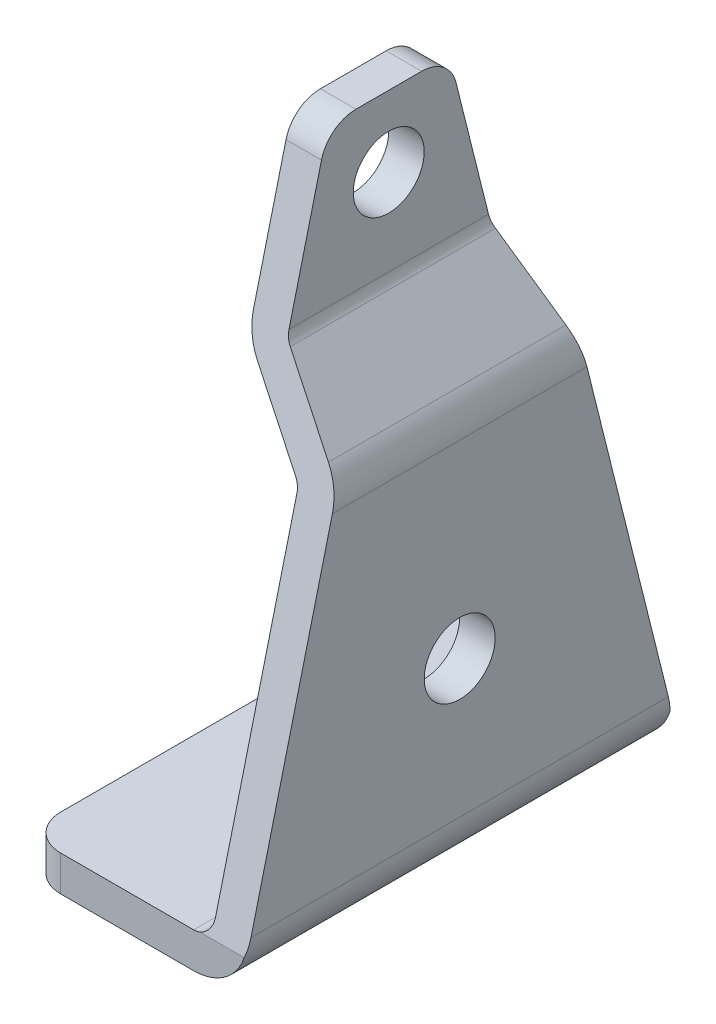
ISO-10303-21;
HEADER;
FILE_DESCRIPTION(('STEP AP214'),'2;1');
FILE_NAME('part.step','',(''),(''),'','','');
FILE_SCHEMA(('AUTOMOTIVE_DESIGN { 1 0 10303 214 1 1 1 1 }'));
ENDSEC;
DATA;
#1=APPLICATION_CONTEXT('core data for automotive mechanical design processes');
#2=APPLICATION_PROTOCOL_DEFINITION('international standard','automotive_design',2000,#1);
#3=PRODUCT_CONTEXT('',#1,'mechanical');
#4=PRODUCT('Part','Part','',(#3));
#5=PRODUCT_RELATED_PRODUCT_CATEGORY('part','',(#4));
#6=PRODUCT_DEFINITION_FORMATION('','',#4);
#7=PRODUCT_DEFINITION_CONTEXT('part definition',#1,'design');
#8=PRODUCT_DEFINITION('design','',#6,#7);
#9=PRODUCT_DEFINITION_SHAPE('','',#8);
#10=(LENGTH_UNIT() NAMED_UNIT(*) SI_UNIT(.MILLI.,.METRE.));
#11=(NAMED_UNIT(*) PLANE_ANGLE_UNIT() SI_UNIT($,.RADIAN.));
#12=(NAMED_UNIT(*) SI_UNIT($,.STERADIAN.) SOLID_ANGLE_UNIT());
#13=UNCERTAINTY_MEASURE_WITH_UNIT(LENGTH_MEASURE(1.E-05),#10,'distance_accuracy_value','');
#14=(GEOMETRIC_REPRESENTATION_CONTEXT(3) GLOBAL_UNCERTAINTY_ASSIGNED_CONTEXT((#13)) GLOBAL_UNIT_ASSIGNED_CONTEXT((#10,
#11,#12)) REPRESENTATION_CONTEXT('',''));
#15=CARTESIAN_POINT('',(0.,0.,0.));
#16=DIRECTION('',(0.,0.,1.));
#17=DIRECTION('',(1.,0.,0.));
#18=AXIS2_PLACEMENT_3D('',#15,#16,#17);
#19=CARTESIAN_POINT('',(0.,4.,48.));
#20=DIRECTION('',(1.,0.,0.));
#21=DIRECTION('',(0.,1.,0.));
#22=AXIS2_PLACEMENT_3D('',#19,#20,#21);
#23=PLANE('',#22);
#24=DIRECTION('',(0.,0.,-1.));
#25=VECTOR('',#24,1.);
#26=CARTESIAN_POINT('',(0.,0.,48.));
#27=LINE('',#26,#25);
#28=CARTESIAN_POINT('',(0.,0.,44.));
#29=VERTEX_POINT('',#28);
#30=CARTESIAN_POINT('',(0.,0.,4.));
#31=VERTEX_POINT('',#30);
#32=EDGE_CURVE('E221',#29,#31,#27,.T.);
#33=ORIENTED_EDGE('',*,*,#32,.F.);
#34=DIRECTION('',(0.,-1.,0.));
#35=VECTOR('',#34,1.);
#36=CARTESIAN_POINT('',(0.,4.,44.));
#37=LINE('',#36,#35);
#38=CARTESIAN_POINT('',(0.,4.,44.));
#39=VERTEX_POINT('',#38);
#40=EDGE_CURVE('E257',#29,#39,#37,.F.);
#41=ORIENTED_EDGE('',*,*,#40,.T.);
#42=DIRECTION('',(0.,0.,-1.));
#43=VECTOR('',#42,1.);
#44=CARTESIAN_POINT('',(0.,4.,48.));
#45=LINE('',#44,#43);
#46=CARTESIAN_POINT('',(0.,4.,4.));
#47=VERTEX_POINT('',#46);
#48=EDGE_CURVE('E266',#39,#47,#45,.T.);
#49=ORIENTED_EDGE('',*,*,#48,.T.);
#50=DIRECTION('',(0.,-1.,0.));
#51=VECTOR('',#50,1.);
#52=CARTESIAN_POINT('',(0.,0.,4.));
#53=LINE('',#52,#51);
#54=EDGE_CURVE('E254',#47,#31,#53,.T.);
#55=ORIENTED_EDGE('',*,*,#54,.T.);
#56=EDGE_LOOP('',(#33,#41,#49,#55));
#57=FACE_BOUND('',#56,.T.);
#58=ADVANCED_FACE('F34',(#57),#23,.F.);
#59=CARTESIAN_POINT('',(0.,0.,48.));
#60=DIRECTION('',(0.,1.,0.));
#61=DIRECTION('',(0.,0.,1.));
#62=AXIS2_PLACEMENT_3D('',#59,#60,#61);
#63=PLANE('',#62);
#64=DIRECTION('',(1.,0.,0.));
#65=VECTOR('',#64,1.);
#66=CARTESIAN_POINT('',(0.,0.,48.));
#67=LINE('',#66,#65);
#68=CARTESIAN_POINT('',(4.,0.,48.));
#69=VERTEX_POINT('',#68);
#70=CARTESIAN_POINT('',(19.,0.,48.));
#71=VERTEX_POINT('',#70);
#72=EDGE_CURVE('E282',#69,#71,#67,.T.);
#73=ORIENTED_EDGE('',*,*,#72,.F.);
#74=CARTESIAN_POINT('',(4.,0.,44.));
#75=DIRECTION('',(0.,1.,0.));
#76=DIRECTION('',(0.,0.,1.));
#77=AXIS2_PLACEMENT_3D('',#74,#75,#76);
#78=CIRCLE('',#77,4.);
#79=EDGE_CURVE('E252',#69,#29,#78,.F.);
#80=ORIENTED_EDGE('',*,*,#79,.T.);
#81=ORIENTED_EDGE('',*,*,#32,.T.);
#82=CARTESIAN_POINT('',(4.,0.,4.));
#83=DIRECTION('',(0.,1.,0.));
#84=DIRECTION('',(0.,0.,1.));
#85=AXIS2_PLACEMENT_3D('',#82,#83,#84);
#86=CIRCLE('',#85,4.);
#87=CARTESIAN_POINT('',(4.,0.,0.));
#88=VERTEX_POINT('',#87);
#89=EDGE_CURVE('E250',#31,#88,#86,.F.);
#90=ORIENTED_EDGE('',*,*,#89,.T.);
#91=DIRECTION('',(1.,0.,0.));
#92=VECTOR('',#91,1.);
#93=CARTESIAN_POINT('',(0.,0.,0.));
#94=LINE('',#93,#92);
#95=CARTESIAN_POINT('',(19.,0.,0.));
#96=VERTEX_POINT('',#95);
#97=EDGE_CURVE('E287',#88,#96,#94,.T.);
#98=ORIENTED_EDGE('',*,*,#97,.T.);
#99=DIRECTION('',(0.,0.,-1.));
#100=VECTOR('',#99,1.);
#101=CARTESIAN_POINT('',(19.,0.,48.));
#102=LINE('',#101,#100);
#103=EDGE_CURVE('E213',#71,#96,#102,.T.);
#104=ORIENTED_EDGE('',*,*,#103,.F.);
#105=EDGE_LOOP('',(#73,#80,#81,#90,#98,#104));
#106=FACE_BOUND('',#105,.T.);
#107=ADVANCED_FACE('F280',(#106),#63,.F.);
#108=CARTESIAN_POINT('',(19.,6.,48.));
#109=DIRECTION('',(0.,0.,-1.));
#110=DIRECTION('',(-1.,0.,0.));
#111=AXIS2_PLACEMENT_3D('',#108,#109,#110);
#112=CYLINDRICAL_SURFACE('',#111,6.);
#113=CARTESIAN_POINT('',(19.,6.,0.));
#114=DIRECTION('',(0.,0.,1.));
#115=DIRECTION('',(-1.,0.,0.));
#116=AXIS2_PLACEMENT_3D('',#113,#114,#115);
#117=CIRCLE('',#116,6.);
#118=CARTESIAN_POINT('',(24.7023240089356,4.13358608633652,0.));
#119=VERTEX_POINT('',#118);
#120=EDGE_CURVE('E292',#96,#119,#117,.T.);
#121=ORIENTED_EDGE('',*,*,#120,.T.);
#122=CARTESIAN_POINT('',(19.,6.,0.465349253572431));
#123=DIRECTION('',(0.,-0.24192189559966,0.970295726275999));
#124=DIRECTION('',(0.,-0.970295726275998,-0.24192189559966));
#125=AXIS2_PLACEMENT_3D('',#122,#123,#124);
#126=ELLIPSE('',#125,6.18368177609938,6.);
#127=CARTESIAN_POINT('',(25.,6.00000000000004,0.465349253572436));
#128=VERTEX_POINT('',#127);
#129=EDGE_CURVE('E195',#119,#128,#126,.T.);
#130=ORIENTED_EDGE('',*,*,#129,.T.);
#131=DIRECTION('',(0.,0.,-1.));
#132=VECTOR('',#131,1.);
#133=CARTESIAN_POINT('',(25.,6.00000000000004,48.));
#134=LINE('',#133,#132);
#135=CARTESIAN_POINT('',(25.,6.00000000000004,47.5346507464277));
#136=VERTEX_POINT('',#135);
#137=EDGE_CURVE('E204',#136,#128,#134,.T.);
#138=ORIENTED_EDGE('',*,*,#137,.F.);
#139=CARTESIAN_POINT('',(19.,6.,47.5346507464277));
#140=DIRECTION('',(0.,-0.241921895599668,-0.970295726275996));
#141=DIRECTION('',(0.,0.970295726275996,-0.241921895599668));
#142=AXIS2_PLACEMENT_3D('',#139,#140,#141);
#143=ELLIPSE('',#142,6.18368177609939,6.);
#144=CARTESIAN_POINT('',(24.7023240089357,4.13358608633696,48.));
#145=VERTEX_POINT('',#144);
#146=EDGE_CURVE('E293',#136,#145,#143,.T.);
#147=ORIENTED_EDGE('',*,*,#146,.T.);
#148=CARTESIAN_POINT('',(19.,6.,48.));
#149=DIRECTION('',(0.,0.,1.));
#150=DIRECTION('',(-1.,0.,0.));
#151=AXIS2_PLACEMENT_3D('',#148,#149,#150);
#152=CIRCLE('',#151,6.);
#153=EDGE_CURVE('E305',#71,#145,#152,.T.);
#154=ORIENTED_EDGE('',*,*,#153,.F.);
#155=ORIENTED_EDGE('',*,*,#103,.T.);
#156=EDGE_LOOP('',(#121,#130,#138,#147,#154,#155));
#157=FACE_BOUND('',#156,.T.);
#158=ADVANCED_FACE('F387',(#157),#112,.T.);
#159=CARTESIAN_POINT('',(25.,6.00000000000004,48.));
#160=DIRECTION('',(-1.,0.,0.));
#161=DIRECTION('',(0.,0.,1.));
#162=AXIS2_PLACEMENT_3D('',#159,#160,#161);
#163=PLANE('',#162);
#164=CARTESIAN_POINT('',(25.,21.5,24.));
#165=DIRECTION('',(1.,0.,0.));
#166=DIRECTION('',(0.,0.,-1.));
#167=AXIS2_PLACEMENT_3D('',#164,#165,#166);
#168=CIRCLE('',#167,4.);
#169=CARTESIAN_POINT('',(25.,21.5,20.));
#170=VERTEX_POINT('',#169);
#171=EDGE_CURVE('E593',#170,#170,#168,.T.);
#172=ORIENTED_EDGE('',*,*,#171,.F.);
#173=EDGE_LOOP('',(#172));
#174=FACE_BOUND('',#173,.T.);
#175=ORIENTED_EDGE('',*,*,#137,.T.);
#176=DIRECTION('',(0.,-0.970295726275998,-0.24192189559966));
#177=VECTOR('',#176,1.);
#178=CARTESIAN_POINT('',(25.,4.13358608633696,1.11022302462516E-13));
#179=LINE('',#178,#177);
#180=CARTESIAN_POINT('',(25.,42.8161785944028,9.64465353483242));
#181=VERTEX_POINT('',#180);
#182=EDGE_CURVE('E187',#181,#128,#179,.T.);
#183=ORIENTED_EDGE('',*,*,#182,.F.);
#184=DIRECTION('',(0.,0.,-1.));
#185=VECTOR('',#184,1.);
#186=CARTESIAN_POINT('',(25.,42.8161785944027,48.));
#187=LINE('',#186,#185);
#188=CARTESIAN_POINT('',(25.,42.8161785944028,38.3553464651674));
#189=VERTEX_POINT('',#188);
#190=EDGE_CURVE('E202',#189,#181,#187,.T.);
#191=ORIENTED_EDGE('',*,*,#190,.F.);
#192=DIRECTION('',(0.,0.970295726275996,-0.241921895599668));
#193=VECTOR('',#192,1.);
#194=CARTESIAN_POINT('',(25.,4.13358608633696,48.));
#195=LINE('',#194,#193);
#196=EDGE_CURVE('E355',#136,#189,#195,.T.);
#197=ORIENTED_EDGE('',*,*,#196,.F.);
#198=EDGE_LOOP('',(#175,#183,#191,#197));
#199=FACE_BOUND('',#198,.T.);
#200=ADVANCED_FACE('F200',(#174,#199),#163,.F.);
#201=CARTESIAN_POINT('',(19.,42.8161785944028,48.));
#202=DIRECTION('',(0.,0.,-1.));
#203=DIRECTION('',(-1.,0.,0.));
#204=AXIS2_PLACEMENT_3D('',#201,#202,#203);
#205=CYLINDRICAL_SURFACE('',#204,6.);
#206=ORIENTED_EDGE('',*,*,#190,.T.);
#207=CARTESIAN_POINT('',(19.,42.8161785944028,9.64465353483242));
#208=DIRECTION('',(0.,-0.24192189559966,0.970295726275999));
#209=DIRECTION('',(0.,-0.970295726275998,-0.24192189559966));
#210=AXIS2_PLACEMENT_3D('',#207,#208,#209);
#211=ELLIPSE('',#210,6.18368177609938,6.);
#212=CARTESIAN_POINT('',(23.5962666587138,46.672904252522,10.6062432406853));
#213=VERTEX_POINT('',#212);
#214=EDGE_CURVE('E183',#181,#213,#211,.T.);
#215=ORIENTED_EDGE('',*,*,#214,.T.);
#216=DIRECTION('',(0.,0.,-1.));
#217=VECTOR('',#216,1.);
#218=CARTESIAN_POINT('',(23.5962666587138,46.672904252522,48.));
#219=LINE('',#218,#217);
#220=CARTESIAN_POINT('',(23.5962666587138,46.672904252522,37.3937567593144));
#221=VERTEX_POINT('',#220);
#222=EDGE_CURVE('E211',#221,#213,#219,.T.);
#223=ORIENTED_EDGE('',*,*,#222,.F.);
#224=CARTESIAN_POINT('',(19.,42.8161785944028,38.3553464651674));
#225=DIRECTION('',(0.,-0.241921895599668,-0.970295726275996));
#226=DIRECTION('',(0.,0.970295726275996,-0.241921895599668));
#227=AXIS2_PLACEMENT_3D('',#224,#225,#226);
#228=ELLIPSE('',#227,6.18368177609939,6.);
#229=EDGE_CURVE('E210',#221,#189,#228,.T.);
#230=ORIENTED_EDGE('',*,*,#229,.T.);
#231=EDGE_LOOP('',(#206,#215,#223,#230));
#232=FACE_BOUND('',#231,.T.);
#233=ADVANCED_FACE('F209',(#232),#205,.T.);
#234=CARTESIAN_POINT('',(23.5962666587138,46.672904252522,48.));
#235=DIRECTION('',(-0.766044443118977,-0.642787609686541,0.));
#236=DIRECTION('',(0.642787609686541,-0.766044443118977,0.));
#237=AXIS2_PLACEMENT_3D('',#234,#235,#236);
#238=PLANE('',#237);
#239=ORIENTED_EDGE('',*,*,#222,.T.);
#240=DIRECTION('',(-0.631374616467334,0.752442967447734,0.187605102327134));
#241=VECTOR('',#240,1.);
#242=CARTESIAN_POINT('',(19.1670098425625,51.9514869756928,11.922341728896));
#243=LINE('',#242,#241);
#244=CARTESIAN_POINT('',(17.467911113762,53.976393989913,12.4272077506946));
#245=VERTEX_POINT('',#244);
#246=EDGE_CURVE('E190',#213,#245,#243,.T.);
#247=ORIENTED_EDGE('',*,*,#246,.T.);
#248=DIRECTION('',(0.,0.,-1.));
#249=VECTOR('',#248,1.);
#250=CARTESIAN_POINT('',(17.467911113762,53.976393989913,48.));
#251=LINE('',#250,#249);
#252=CARTESIAN_POINT('',(17.467911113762,53.976393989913,35.5727922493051));
#253=VERTEX_POINT('',#252);
#254=EDGE_CURVE('E215',#253,#245,#251,.T.);
#255=ORIENTED_EDGE('',*,*,#254,.F.);
#256=DIRECTION('',(0.631374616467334,-0.752442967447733,0.18760510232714));
#257=VECTOR('',#256,1.);
#258=CARTESIAN_POINT('',(24.8525666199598,45.1757042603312,37.7670506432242));
#259=LINE('',#258,#257);
#260=EDGE_CURVE('E348',#253,#221,#259,.T.);
#261=ORIENTED_EDGE('',*,*,#260,.T.);
#262=EDGE_LOOP('',(#239,#247,#255,#261));
#263=FACE_BOUND('',#262,.T.);
#264=ADVANCED_FACE('F347',(#263),#238,.F.);
#265=CARTESIAN_POINT('',(19.,55.2619692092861,48.));
#266=DIRECTION('',(0.,0.,-1.));
#267=DIRECTION('',(-1.,0.,0.));
#268=AXIS2_PLACEMENT_3D('',#265,#266,#267);
#269=CYLINDRICAL_SURFACE('',#268,2.);
#270=ORIENTED_EDGE('',*,*,#254,.T.);
#271=CARTESIAN_POINT('',(19.,55.2619692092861,12.7477376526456));
#272=DIRECTION('',(0.,-0.24192189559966,0.970295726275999));
#273=DIRECTION('',(0.,-0.970295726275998,-0.24192189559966));
#274=AXIS2_PLACEMENT_3D('',#271,#272,#273);
#275=ELLIPSE('',#274,2.06122725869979,2.);
#276=CARTESIAN_POINT('',(17.,55.2619692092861,12.7477376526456));
#277=VERTEX_POINT('',#276);
#278=EDGE_CURVE('E342',#245,#277,#275,.F.);
#279=ORIENTED_EDGE('',*,*,#278,.T.);
#280=DIRECTION('',(0.,0.,-1.));
#281=VECTOR('',#280,1.);
#282=CARTESIAN_POINT('',(17.,55.2619692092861,48.));
#283=LINE('',#282,#281);
#284=CARTESIAN_POINT('',(17.,55.2619692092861,35.2522623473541));
#285=VERTEX_POINT('',#284);
#286=EDGE_CURVE('E333',#285,#277,#283,.T.);
#287=ORIENTED_EDGE('',*,*,#286,.F.);
#288=CARTESIAN_POINT('',(19.,55.2619692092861,35.2522623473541));
#289=DIRECTION('',(0.,-0.241921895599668,-0.970295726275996));
#290=DIRECTION('',(0.,0.970295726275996,-0.241921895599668));
#291=AXIS2_PLACEMENT_3D('',#288,#289,#290);
#292=ELLIPSE('',#291,2.0612272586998,2.);
#293=EDGE_CURVE('E344',#285,#253,#292,.F.);
#294=ORIENTED_EDGE('',*,*,#293,.T.);
#295=EDGE_LOOP('',(#270,#279,#287,#294));
#296=FACE_BOUND('',#295,.T.);
#297=ADVANCED_FACE('F340',(#296),#269,.F.);
#298=CARTESIAN_POINT('',(17.,55.2619692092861,48.));
#299=DIRECTION('',(-1.,0.,0.));
#300=DIRECTION('',(0.,0.,1.));
#301=AXIS2_PLACEMENT_3D('',#298,#299,#300);
#302=PLANE('',#301);
#303=CARTESIAN_POINT('',(17.,65.,24.));
#304=DIRECTION('',(-1.,0.,0.));
#305=DIRECTION('',(0.,0.,1.));
#306=AXIS2_PLACEMENT_3D('',#303,#304,#305);
#307=CIRCLE('',#306,4.);
#308=CARTESIAN_POINT('',(17.,65.,28.));
#309=VERTEX_POINT('',#308);
#310=EDGE_CURVE('E206',#309,#309,#307,.T.);
#311=ORIENTED_EDGE('',*,*,#310,.T.);
#312=EDGE_LOOP('',(#311));
#313=FACE_BOUND('',#312,.T.);
#314=DIRECTION('',(0.,0.,-1.));
#315=VECTOR('',#314,1.);
#316=CARTESIAN_POINT('',(17.,73.,48.));
#317=LINE('',#316,#315);
#318=CARTESIAN_POINT('',(17.,73.,27.7045320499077));
#319=VERTEX_POINT('',#318);
#320=CARTESIAN_POINT('',(17.,73.,20.2954679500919));
#321=VERTEX_POINT('',#320);
#322=EDGE_CURVE('E330',#319,#321,#317,.T.);
#323=ORIENTED_EDGE('',*,*,#322,.F.);
#324=CARTESIAN_POINT('',(17.,69.,27.7045320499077));
#325=DIRECTION('',(-1.,0.,0.));
#326=DIRECTION('',(0.,0.,1.));
#327=AXIS2_PLACEMENT_3D('',#324,#325,#326);
#328=CIRCLE('',#327,4.);
#329=CARTESIAN_POINT('',(17.,69.9676875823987,31.5857149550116));
#330=VERTEX_POINT('',#329);
#331=EDGE_CURVE('E236',#319,#330,#328,.F.);
#332=ORIENTED_EDGE('',*,*,#331,.T.);
#333=DIRECTION('',(0.,-0.970295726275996,0.241921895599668));
#334=VECTOR('',#333,1.);
#335=CARTESIAN_POINT('',(17.,52.2696190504,35.9983390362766));
#336=LINE('',#335,#334);
#337=EDGE_CURVE('E375',#330,#285,#336,.T.);
#338=ORIENTED_EDGE('',*,*,#337,.T.);
#339=ORIENTED_EDGE('',*,*,#286,.T.);
#340=DIRECTION('',(0.,0.970295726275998,0.24192189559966));
#341=VECTOR('',#340,1.);
#342=CARTESIAN_POINT('',(17.,63.5369365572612,14.8109187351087));
#343=LINE('',#342,#341);
#344=CARTESIAN_POINT('',(17.,69.9676875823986,16.4142850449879));
#345=VERTEX_POINT('',#344);
#346=EDGE_CURVE('E350',#277,#345,#343,.T.);
#347=ORIENTED_EDGE('',*,*,#346,.T.);
#348=CARTESIAN_POINT('',(17.,69.,20.2954679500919));
#349=DIRECTION('',(-1.,0.,0.));
#350=DIRECTION('',(0.,0.,1.));
#351=AXIS2_PLACEMENT_3D('',#348,#349,#350);
#352=CIRCLE('',#351,4.);
#353=EDGE_CURVE('E234',#345,#321,#352,.F.);
#354=ORIENTED_EDGE('',*,*,#353,.T.);
#355=EDGE_LOOP('',(#323,#332,#338,#339,#347,#354));
#356=FACE_BOUND('',#355,.T.);
#357=ADVANCED_FACE('F381',(#313,#356),#302,.F.);
#358=CARTESIAN_POINT('',(17.,73.,48.));
#359=DIRECTION('',(0.,-1.,0.));
#360=DIRECTION('',(0.,0.,-1.));
#361=AXIS2_PLACEMENT_3D('',#358,#359,#360);
#362=PLANE('',#361);
#363=DIRECTION('',(0.,0.,-1.));
#364=VECTOR('',#363,1.);
#365=CARTESIAN_POINT('',(13.,73.,48.));
#366=LINE('',#365,#364);
#367=CARTESIAN_POINT('',(13.,73.,27.7045320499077));
#368=VERTEX_POINT('',#367);
#369=CARTESIAN_POINT('',(13.,73.,20.2954679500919));
#370=VERTEX_POINT('',#369);
#371=EDGE_CURVE('E327',#368,#370,#366,.T.);
#372=ORIENTED_EDGE('',*,*,#371,.F.);
#373=DIRECTION('',(1.,0.,0.));
#374=VECTOR('',#373,1.);
#375=CARTESIAN_POINT('',(17.,73.,27.7045320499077));
#376=LINE('',#375,#374);
#377=EDGE_CURVE('E231',#368,#319,#376,.T.);
#378=ORIENTED_EDGE('',*,*,#377,.T.);
#379=ORIENTED_EDGE('',*,*,#322,.T.);
#380=DIRECTION('',(1.,0.,0.));
#381=VECTOR('',#380,1.);
#382=CARTESIAN_POINT('',(17.,73.,20.2954679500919));
#383=LINE('',#382,#381);
#384=EDGE_CURVE('E229',#321,#370,#383,.F.);
#385=ORIENTED_EDGE('',*,*,#384,.T.);
#386=EDGE_LOOP('',(#372,#378,#379,#385));
#387=FACE_BOUND('',#386,.T.);
#388=ADVANCED_FACE('F418',(#387),#362,.F.);
#389=CARTESIAN_POINT('',(13.,73.,48.));
#390=DIRECTION('',(1.,0.,0.));
#391=DIRECTION('',(0.,1.,0.));
#392=AXIS2_PLACEMENT_3D('',#389,#390,#391);
#393=PLANE('',#392);
#394=CARTESIAN_POINT('',(13.,65.,24.));
#395=DIRECTION('',(-1.,0.,0.));
#396=DIRECTION('',(0.,-1.,0.));
#397=AXIS2_PLACEMENT_3D('',#394,#395,#396);
#398=CIRCLE('',#397,4.);
#399=CARTESIAN_POINT('',(13.,61.,24.));
#400=VERTEX_POINT('',#399);
#401=EDGE_CURVE('E595',#400,#400,#398,.T.);
#402=ORIENTED_EDGE('',*,*,#401,.F.);
#403=EDGE_LOOP('',(#402));
#404=FACE_BOUND('',#403,.T.);
#405=DIRECTION('',(0.,0.970295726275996,-0.241921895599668));
#406=VECTOR('',#405,1.);
#407=CARTESIAN_POINT('',(13.,68.9695102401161,31.8345885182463));
#408=LINE('',#407,#406);
#409=CARTESIAN_POINT('',(13.,55.2619692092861,35.2522623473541));
#410=VERTEX_POINT('',#409);
#411=CARTESIAN_POINT('',(13.,69.9676875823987,31.5857149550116));
#412=VERTEX_POINT('',#411);
#413=EDGE_CURVE('E372',#410,#412,#408,.T.);
#414=ORIENTED_EDGE('',*,*,#413,.T.);
#415=CARTESIAN_POINT('',(13.,69.,27.7045320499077));
#416=DIRECTION('',(1.,0.,0.));
#417=DIRECTION('',(0.,1.,0.));
#418=AXIS2_PLACEMENT_3D('',#415,#416,#417);
#419=CIRCLE('',#418,4.);
#420=EDGE_CURVE('E242',#412,#368,#419,.F.);
#421=ORIENTED_EDGE('',*,*,#420,.T.);
#422=ORIENTED_EDGE('',*,*,#371,.T.);
#423=CARTESIAN_POINT('',(13.,69.,20.2954679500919));
#424=DIRECTION('',(1.,0.,0.));
#425=DIRECTION('',(0.,1.,0.));
#426=AXIS2_PLACEMENT_3D('',#423,#424,#425);
#427=CIRCLE('',#426,4.);
#428=CARTESIAN_POINT('',(13.,69.9676875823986,16.4142850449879));
#429=VERTEX_POINT('',#428);
#430=EDGE_CURVE('E240',#370,#429,#427,.F.);
#431=ORIENTED_EDGE('',*,*,#430,.T.);
#432=DIRECTION('',(0.,-0.970295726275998,-0.24192189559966));
#433=VECTOR('',#432,1.);
#434=CARTESIAN_POINT('',(13.,80.2368277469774,18.9746692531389));
#435=LINE('',#434,#433);
#436=CARTESIAN_POINT('',(13.,55.2619692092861,12.7477376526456));
#437=VERTEX_POINT('',#436);
#438=EDGE_CURVE('E409',#429,#437,#435,.T.);
#439=ORIENTED_EDGE('',*,*,#438,.T.);
#440=DIRECTION('',(0.,0.,-1.));
#441=VECTOR('',#440,1.);
#442=CARTESIAN_POINT('',(13.,55.2619692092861,48.));
#443=LINE('',#442,#441);
#444=EDGE_CURVE('E324',#410,#437,#443,.T.);
#445=ORIENTED_EDGE('',*,*,#444,.F.);
#446=EDGE_LOOP('',(#414,#421,#422,#431,#439,#445));
#447=FACE_BOUND('',#446,.T.);
#448=ADVANCED_FACE('F421',(#404,#447),#393,.F.);
#449=CARTESIAN_POINT('',(19.,55.261969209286,48.));
#450=DIRECTION('',(0.,0.,-1.));
#451=DIRECTION('',(-1.,0.,0.));
#452=AXIS2_PLACEMENT_3D('',#449,#450,#451);
#453=CYLINDRICAL_SURFACE('',#452,6.);
#454=ORIENTED_EDGE('',*,*,#444,.T.);
#455=CARTESIAN_POINT('',(19.,55.261969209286,12.7477376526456));
#456=DIRECTION('',(0.,-0.24192189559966,0.970295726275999));
#457=DIRECTION('',(0.,-0.970295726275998,-0.24192189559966));
#458=AXIS2_PLACEMENT_3D('',#455,#456,#457);
#459=ELLIPSE('',#458,6.18368177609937,6.);
#460=CARTESIAN_POINT('',(14.4037333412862,51.4052435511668,11.7861479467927));
#461=VERTEX_POINT('',#460);
#462=EDGE_CURVE('E406',#437,#461,#459,.T.);
#463=ORIENTED_EDGE('',*,*,#462,.T.);
#464=DIRECTION('',(0.,0.,-1.));
#465=VECTOR('',#464,1.);
#466=CARTESIAN_POINT('',(14.4037333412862,51.4052435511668,48.));
#467=LINE('',#466,#465);
#468=CARTESIAN_POINT('',(14.4037333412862,51.4052435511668,36.213852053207));
#469=VERTEX_POINT('',#468);
#470=EDGE_CURVE('E321',#469,#461,#467,.T.);
#471=ORIENTED_EDGE('',*,*,#470,.F.);
#472=CARTESIAN_POINT('',(19.,55.261969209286,35.2522623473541));
#473=DIRECTION('',(0.,-0.241921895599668,-0.970295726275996));
#474=DIRECTION('',(0.,0.970295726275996,-0.241921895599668));
#475=AXIS2_PLACEMENT_3D('',#472,#473,#474);
#476=ELLIPSE('',#475,6.18368177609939,6.);
#477=EDGE_CURVE('E369',#469,#410,#476,.T.);
#478=ORIENTED_EDGE('',*,*,#477,.T.);
#479=EDGE_LOOP('',(#454,#463,#471,#478));
#480=FACE_BOUND('',#479,.T.);
#481=ADVANCED_FACE('F428',(#480),#453,.T.);
#482=CARTESIAN_POINT('',(14.4037333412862,51.4052435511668,48.));
#483=DIRECTION('',(0.766044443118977,0.642787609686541,0.));
#484=DIRECTION('',(-0.642787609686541,0.766044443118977,0.));
#485=AXIS2_PLACEMENT_3D('',#482,#483,#484);
#486=PLANE('',#485);
#487=ORIENTED_EDGE('',*,*,#470,.T.);
#488=DIRECTION('',(0.631374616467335,-0.752442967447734,-0.187605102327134));
#489=VECTOR('',#488,1.);
#490=CARTESIAN_POINT('',(10.1142351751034,56.5172684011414,13.0607188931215));
#491=LINE('',#490,#489);
#492=CARTESIAN_POINT('',(20.5320888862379,44.1017538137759,9.96518343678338));
#493=VERTEX_POINT('',#492);
#494=EDGE_CURVE('E403',#461,#493,#491,.T.);
#495=ORIENTED_EDGE('',*,*,#494,.T.);
#496=DIRECTION('',(0.,0.,-1.));
#497=VECTOR('',#496,1.);
#498=CARTESIAN_POINT('',(20.5320888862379,44.1017538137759,48.));
#499=LINE('',#498,#497);
#500=CARTESIAN_POINT('',(20.5320888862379,44.1017538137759,38.0348165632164));
#501=VERTEX_POINT('',#500);
#502=EDGE_CURVE('E318',#501,#493,#499,.T.);
#503=ORIENTED_EDGE('',*,*,#502,.F.);
#504=DIRECTION('',(-0.631374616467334,0.752442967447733,-0.18760510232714));
#505=VECTOR('',#504,1.);
#506=CARTESIAN_POINT('',(15.7997919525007,49.7414856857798,36.6286734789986));
#507=LINE('',#506,#505);
#508=EDGE_CURVE('E366',#501,#469,#507,.T.);
#509=ORIENTED_EDGE('',*,*,#508,.T.);
#510=EDGE_LOOP('',(#487,#495,#503,#509));
#511=FACE_BOUND('',#510,.T.);
#512=ADVANCED_FACE('F430',(#511),#486,.F.);
#513=CARTESIAN_POINT('',(19.,42.8161785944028,48.));
#514=DIRECTION('',(0.,0.,-1.));
#515=DIRECTION('',(-1.,0.,0.));
#516=AXIS2_PLACEMENT_3D('',#513,#514,#515);
#517=CYLINDRICAL_SURFACE('',#516,2.);
#518=ORIENTED_EDGE('',*,*,#502,.T.);
#519=CARTESIAN_POINT('',(19.,42.8161785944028,9.64465353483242));
#520=DIRECTION('',(0.,-0.24192189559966,0.970295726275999));
#521=DIRECTION('',(0.,-0.970295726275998,-0.24192189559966));
#522=AXIS2_PLACEMENT_3D('',#519,#520,#521);
#523=ELLIPSE('',#522,2.06122725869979,2.);
#524=CARTESIAN_POINT('',(21.,42.8161785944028,9.64465353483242));
#525=VERTEX_POINT('',#524);
#526=EDGE_CURVE('E397',#493,#525,#523,.F.);
#527=ORIENTED_EDGE('',*,*,#526,.T.);
#528=DIRECTION('',(0.,0.,-1.));
#529=VECTOR('',#528,1.);
#530=CARTESIAN_POINT('',(21.,42.8161785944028,48.));
#531=LINE('',#530,#529);
#532=CARTESIAN_POINT('',(21.,42.8161785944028,38.3553464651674));
#533=VERTEX_POINT('',#532);
#534=EDGE_CURVE('E315',#533,#525,#531,.T.);
#535=ORIENTED_EDGE('',*,*,#534,.F.);
#536=CARTESIAN_POINT('',(19.,42.8161785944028,38.3553464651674));
#537=DIRECTION('',(0.,-0.241921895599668,-0.970295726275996));
#538=DIRECTION('',(0.,0.970295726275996,-0.241921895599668));
#539=AXIS2_PLACEMENT_3D('',#536,#537,#538);
#540=ELLIPSE('',#539,2.0612272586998,2.);
#541=EDGE_CURVE('E363',#533,#501,#540,.F.);
#542=ORIENTED_EDGE('',*,*,#541,.T.);
#543=EDGE_LOOP('',(#518,#527,#535,#542));
#544=FACE_BOUND('',#543,.T.);
#545=ADVANCED_FACE('F434',(#544),#517,.F.);
#546=CARTESIAN_POINT('',(21.,42.8161785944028,48.));
#547=DIRECTION('',(1.,0.,0.));
#548=DIRECTION('',(0.,0.,-1.));
#549=AXIS2_PLACEMENT_3D('',#546,#547,#548);
#550=PLANE('',#549);
#551=CARTESIAN_POINT('',(21.,21.5,24.));
#552=DIRECTION('',(1.,0.,0.));
#553=DIRECTION('',(0.,0.,-1.));
#554=AXIS2_PLACEMENT_3D('',#551,#552,#553);
#555=CIRCLE('',#554,4.);
#556=CARTESIAN_POINT('',(21.,21.5,20.));
#557=VERTEX_POINT('',#556);
#558=EDGE_CURVE('E37',#557,#557,#555,.T.);
#559=ORIENTED_EDGE('',*,*,#558,.T.);
#560=EDGE_LOOP('',(#559));
#561=FACE_BOUND('',#560,.T.);
#562=ORIENTED_EDGE('',*,*,#534,.T.);
#563=DIRECTION('',(0.,-0.970295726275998,-0.24192189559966));
#564=VECTOR('',#563,1.);
#565=CARTESIAN_POINT('',(21.,51.8195508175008,11.8894463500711));
#566=LINE('',#565,#564);
#567=CARTESIAN_POINT('',(21.,6.00000000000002,0.465349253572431));
#568=VERTEX_POINT('',#567);
#569=EDGE_CURVE('E395',#525,#568,#566,.T.);
#570=ORIENTED_EDGE('',*,*,#569,.T.);
#571=DIRECTION('',(0.,0.,-1.));
#572=VECTOR('',#571,1.);
#573=CARTESIAN_POINT('',(21.,6.00000000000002,48.));
#574=LINE('',#573,#572);
#575=CARTESIAN_POINT('',(21.,6.00000000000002,47.5346507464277));
#576=VERTEX_POINT('',#575);
#577=EDGE_CURVE('E312',#576,#568,#574,.T.);
#578=ORIENTED_EDGE('',*,*,#577,.F.);
#579=DIRECTION('',(0.,0.970295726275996,-0.241921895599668));
#580=VECTOR('',#579,1.);
#581=CARTESIAN_POINT('',(21.,40.5522333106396,38.9198114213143));
#582=LINE('',#581,#580);
#583=EDGE_CURVE('E360',#576,#533,#582,.T.);
#584=ORIENTED_EDGE('',*,*,#583,.T.);
#585=EDGE_LOOP('',(#562,#570,#578,#584));
#586=FACE_BOUND('',#585,.T.);
#587=ADVANCED_FACE('F436',(#561,#586),#550,.F.);
#588=CARTESIAN_POINT('',(19.,6.,48.));
#589=DIRECTION('',(0.,0.,-1.));
#590=DIRECTION('',(-1.,0.,0.));
#591=AXIS2_PLACEMENT_3D('',#588,#589,#590);
#592=CYLINDRICAL_SURFACE('',#591,2.);
#593=ORIENTED_EDGE('',*,*,#577,.T.);
#594=CARTESIAN_POINT('',(19.,6.,0.465349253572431));
#595=DIRECTION('',(0.,-0.24192189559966,0.970295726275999));
#596=DIRECTION('',(0.,-0.970295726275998,-0.24192189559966));
#597=AXIS2_PLACEMENT_3D('',#594,#595,#596);
#598=ELLIPSE('',#597,2.06122725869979,2.);
#599=CARTESIAN_POINT('',(19.7186787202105,4.13358608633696,1.11022302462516E-13));
#600=VERTEX_POINT('',#599);
#601=EDGE_CURVE('E205',#568,#600,#598,.F.);
#602=ORIENTED_EDGE('',*,*,#601,.T.);
#603=CARTESIAN_POINT('',(19.,6.,0.));
#604=DIRECTION('',(0.,0.,-1.));
#605=DIRECTION('',(1.,0.,0.));
#606=AXIS2_PLACEMENT_3D('',#603,#604,#605);
#607=CIRCLE('',#606,2.);
#608=CARTESIAN_POINT('',(19.,4.,0.));
#609=VERTEX_POINT('',#608);
#610=EDGE_CURVE('E295',#600,#609,#607,.T.);
#611=ORIENTED_EDGE('',*,*,#610,.T.);
#612=DIRECTION('',(0.,0.,-1.));
#613=VECTOR('',#612,1.);
#614=CARTESIAN_POINT('',(19.,4.,48.));
#615=LINE('',#614,#613);
#616=CARTESIAN_POINT('',(19.,4.,48.));
#617=VERTEX_POINT('',#616);
#618=EDGE_CURVE('E310',#617,#609,#615,.T.);
#619=ORIENTED_EDGE('',*,*,#618,.F.);
#620=CARTESIAN_POINT('',(19.,6.,48.));
#621=DIRECTION('',(0.,0.,-1.));
#622=DIRECTION('',(1.,0.,0.));
#623=AXIS2_PLACEMENT_3D('',#620,#621,#622);
#624=CIRCLE('',#623,2.);
#625=CARTESIAN_POINT('',(19.7186787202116,4.13358608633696,48.));
#626=VERTEX_POINT('',#625);
#627=EDGE_CURVE('E274',#626,#617,#624,.T.);
#628=ORIENTED_EDGE('',*,*,#627,.F.);
#629=CARTESIAN_POINT('',(19.,6.,47.5346507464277));
#630=DIRECTION('',(0.,-0.241921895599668,-0.970295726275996));
#631=DIRECTION('',(0.,0.970295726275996,-0.241921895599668));
#632=AXIS2_PLACEMENT_3D('',#629,#630,#631);
#633=ELLIPSE('',#632,2.0612272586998,2.);
#634=EDGE_CURVE('E357',#626,#576,#633,.F.);
#635=ORIENTED_EDGE('',*,*,#634,.T.);
#636=EDGE_LOOP('',(#593,#602,#611,#619,#628,#635));
#637=FACE_BOUND('',#636,.T.);
#638=ADVANCED_FACE('F392',(#637),#592,.F.);
#639=CARTESIAN_POINT('',(19.,4.,48.));
#640=DIRECTION('',(0.,-1.,0.));
#641=DIRECTION('',(1.,0.,0.));
#642=AXIS2_PLACEMENT_3D('',#639,#640,#641);
#643=PLANE('',#642);
#644=ORIENTED_EDGE('',*,*,#48,.F.);
#645=CARTESIAN_POINT('',(4.,4.,44.));
#646=DIRECTION('',(0.,-1.,0.));
#647=DIRECTION('',(1.,0.,0.));
#648=AXIS2_PLACEMENT_3D('',#645,#646,#647);
#649=CIRCLE('',#648,4.);
#650=CARTESIAN_POINT('',(4.,4.,48.));
#651=VERTEX_POINT('',#650);
#652=EDGE_CURVE('E42',#39,#651,#649,.F.);
#653=ORIENTED_EDGE('',*,*,#652,.T.);
#654=DIRECTION('',(-1.,0.,0.));
#655=VECTOR('',#654,1.);
#656=CARTESIAN_POINT('',(19.,4.,48.));
#657=LINE('',#656,#655);
#658=EDGE_CURVE('E265',#617,#651,#657,.T.);
#659=ORIENTED_EDGE('',*,*,#658,.F.);
#660=ORIENTED_EDGE('',*,*,#618,.T.);
#661=DIRECTION('',(-1.,0.,0.));
#662=VECTOR('',#661,1.);
#663=CARTESIAN_POINT('',(19.,4.,0.));
#664=LINE('',#663,#662);
#665=CARTESIAN_POINT('',(4.,4.,0.));
#666=VERTEX_POINT('',#665);
#667=EDGE_CURVE('E302',#609,#666,#664,.T.);
#668=ORIENTED_EDGE('',*,*,#667,.T.);
#669=CARTESIAN_POINT('',(4.,4.,4.));
#670=DIRECTION('',(0.,-1.,0.));
#671=DIRECTION('',(1.,0.,0.));
#672=AXIS2_PLACEMENT_3D('',#669,#670,#671);
#673=CIRCLE('',#672,4.);
#674=EDGE_CURVE('E54',#666,#47,#673,.F.);
#675=ORIENTED_EDGE('',*,*,#674,.T.);
#676=EDGE_LOOP('',(#644,#653,#659,#660,#668,#675));
#677=FACE_BOUND('',#676,.T.);
#678=ADVANCED_FACE('F263',(#677),#643,.F.);
#679=CARTESIAN_POINT('',(19.,6.,48.));
#680=DIRECTION('',(0.,0.,-1.));
#681=DIRECTION('',(-1.,0.,0.));
#682=AXIS2_PLACEMENT_3D('',#679,#680,#681);
#683=PLANE('',#682);
#684=ORIENTED_EDGE('',*,*,#658,.T.);
#685=DIRECTION('',(0.,-1.,0.));
#686=VECTOR('',#685,1.);
#687=CARTESIAN_POINT('',(4.,6.,48.));
#688=LINE('',#687,#686);
#689=EDGE_CURVE('E247',#651,#69,#688,.T.);
#690=ORIENTED_EDGE('',*,*,#689,.T.);
#691=ORIENTED_EDGE('',*,*,#72,.T.);
#692=ORIENTED_EDGE('',*,*,#153,.T.);
#693=DIRECTION('',(-1.,0.,0.));
#694=VECTOR('',#693,1.);
#695=CARTESIAN_POINT('',(19.,4.13358608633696,48.));
#696=LINE('',#695,#694);
#697=EDGE_CURVE('E224',#145,#626,#696,.T.);
#698=ORIENTED_EDGE('',*,*,#697,.T.);
#699=ORIENTED_EDGE('',*,*,#627,.T.);
#700=EDGE_LOOP('',(#684,#690,#691,#692,#698,#699));
#701=FACE_BOUND('',#700,.T.);
#702=ADVANCED_FACE('F271',(#701),#683,.F.);
#703=CARTESIAN_POINT('',(19.,6.,0.));
#704=DIRECTION('',(0.,0.,-1.));
#705=DIRECTION('',(-1.,0.,0.));
#706=AXIS2_PLACEMENT_3D('',#703,#704,#705);
#707=PLANE('',#706);
#708=ORIENTED_EDGE('',*,*,#97,.F.);
#709=DIRECTION('',(0.,-1.,0.));
#710=VECTOR('',#709,1.);
#711=CARTESIAN_POINT('',(4.,4.,0.));
#712=LINE('',#711,#710);
#713=EDGE_CURVE('E11',#88,#666,#712,.F.);
#714=ORIENTED_EDGE('',*,*,#713,.T.);
#715=ORIENTED_EDGE('',*,*,#667,.F.);
#716=ORIENTED_EDGE('',*,*,#610,.F.);
#717=DIRECTION('',(-1.,0.,0.));
#718=VECTOR('',#717,1.);
#719=CARTESIAN_POINT('',(19.,4.13358608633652,0.));
#720=LINE('',#719,#718);
#721=EDGE_CURVE('E227',#119,#600,#720,.T.);
#722=ORIENTED_EDGE('',*,*,#721,.F.);
#723=ORIENTED_EDGE('',*,*,#120,.F.);
#724=EDGE_LOOP('',(#708,#714,#715,#716,#722,#723));
#725=FACE_BOUND('',#724,.T.);
#726=ADVANCED_FACE('F289',(#725),#707,.T.);
#727=CARTESIAN_POINT('',(0.,4.13358608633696,48.));
#728=DIRECTION('',(0.,-0.241921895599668,-0.970295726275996));
#729=DIRECTION('',(0.,0.970295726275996,-0.241921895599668));
#730=AXIS2_PLACEMENT_3D('',#727,#728,#729);
#731=PLANE('',#730);
#732=ORIENTED_EDGE('',*,*,#337,.F.);
#733=DIRECTION('',(1.,0.,0.));
#734=VECTOR('',#733,1.);
#735=CARTESIAN_POINT('',(0.,69.9676875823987,31.5857149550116));
#736=LINE('',#735,#734);
#737=EDGE_CURVE('E238',#330,#412,#736,.F.);
#738=ORIENTED_EDGE('',*,*,#737,.T.);
#739=ORIENTED_EDGE('',*,*,#413,.F.);
#740=ORIENTED_EDGE('',*,*,#477,.F.);
#741=ORIENTED_EDGE('',*,*,#508,.F.);
#742=ORIENTED_EDGE('',*,*,#541,.F.);
#743=ORIENTED_EDGE('',*,*,#583,.F.);
#744=ORIENTED_EDGE('',*,*,#634,.F.);
#745=ORIENTED_EDGE('',*,*,#697,.F.);
#746=ORIENTED_EDGE('',*,*,#146,.F.);
#747=ORIENTED_EDGE('',*,*,#196,.T.);
#748=ORIENTED_EDGE('',*,*,#229,.F.);
#749=ORIENTED_EDGE('',*,*,#260,.F.);
#750=ORIENTED_EDGE('',*,*,#293,.F.);
#751=EDGE_LOOP('',(#732,#738,#739,#740,#741,#742,#743,#744,#745,#746,#747,#748,#749,#750));
#752=FACE_BOUND('',#751,.T.);
#753=ADVANCED_FACE('F385',(#752),#731,.F.);
#754=CARTESIAN_POINT('',(0.,4.13358608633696,1.11022302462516E-13));
#755=DIRECTION('',(0.,-0.24192189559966,0.970295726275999));
#756=DIRECTION('',(0.,-0.970295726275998,-0.24192189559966));
#757=AXIS2_PLACEMENT_3D('',#754,#755,#756);
#758=PLANE('',#757);
#759=ORIENTED_EDGE('',*,*,#438,.F.);
#760=DIRECTION('',(1.,0.,0.));
#761=VECTOR('',#760,1.);
#762=CARTESIAN_POINT('',(0.,69.9676875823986,16.4142850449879));
#763=LINE('',#762,#761);
#764=EDGE_CURVE('E244',#429,#345,#763,.T.);
#765=ORIENTED_EDGE('',*,*,#764,.T.);
#766=ORIENTED_EDGE('',*,*,#346,.F.);
#767=ORIENTED_EDGE('',*,*,#278,.F.);
#768=ORIENTED_EDGE('',*,*,#246,.F.);
#769=ORIENTED_EDGE('',*,*,#214,.F.);
#770=ORIENTED_EDGE('',*,*,#182,.T.);
#771=ORIENTED_EDGE('',*,*,#129,.F.);
#772=ORIENTED_EDGE('',*,*,#721,.T.);
#773=ORIENTED_EDGE('',*,*,#601,.F.);
#774=ORIENTED_EDGE('',*,*,#569,.F.);
#775=ORIENTED_EDGE('',*,*,#526,.F.);
#776=ORIENTED_EDGE('',*,*,#494,.F.);
#777=ORIENTED_EDGE('',*,*,#462,.F.);
#778=EDGE_LOOP('',(#759,#765,#766,#767,#768,#769,#770,#771,#772,#773,#774,#775,#776,#777));
#779=FACE_BOUND('',#778,.T.);
#780=ADVANCED_FACE('F186',(#779),#758,.F.);
#781=CARTESIAN_POINT('',(17.,69.,27.7045320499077));
#782=DIRECTION('',(1.,0.,0.));
#783=DIRECTION('',(0.,0.,-1.));
#784=AXIS2_PLACEMENT_3D('',#781,#782,#783);
#785=CYLINDRICAL_SURFACE('',#784,4.);
#786=ORIENTED_EDGE('',*,*,#420,.F.);
#787=ORIENTED_EDGE('',*,*,#737,.F.);
#788=ORIENTED_EDGE('',*,*,#331,.F.);
#789=ORIENTED_EDGE('',*,*,#377,.F.);
#790=EDGE_LOOP('',(#786,#787,#788,#789));
#791=FACE_BOUND('',#790,.T.);
#792=ADVANCED_FACE('F425',(#791),#785,.T.);
#793=CARTESIAN_POINT('',(0.,69.,20.2954679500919));
#794=DIRECTION('',(1.,0.,0.));
#795=DIRECTION('',(0.,0.,-1.));
#796=AXIS2_PLACEMENT_3D('',#793,#794,#795);
#797=CYLINDRICAL_SURFACE('',#796,4.);
#798=ORIENTED_EDGE('',*,*,#430,.F.);
#799=ORIENTED_EDGE('',*,*,#384,.F.);
#800=ORIENTED_EDGE('',*,*,#353,.F.);
#801=ORIENTED_EDGE('',*,*,#764,.F.);
#802=EDGE_LOOP('',(#798,#799,#800,#801));
#803=FACE_BOUND('',#802,.T.);
#804=ADVANCED_FACE('F414',(#803),#797,.T.);
#805=CARTESIAN_POINT('',(4.,6.,44.));
#806=DIRECTION('',(0.,-1.,0.));
#807=DIRECTION('',(1.,0.,0.));
#808=AXIS2_PLACEMENT_3D('',#805,#806,#807);
#809=CYLINDRICAL_SURFACE('',#808,4.);
#810=ORIENTED_EDGE('',*,*,#652,.F.);
#811=ORIENTED_EDGE('',*,*,#40,.F.);
#812=ORIENTED_EDGE('',*,*,#79,.F.);
#813=ORIENTED_EDGE('',*,*,#689,.F.);
#814=EDGE_LOOP('',(#810,#811,#812,#813));
#815=FACE_BOUND('',#814,.T.);
#816=ADVANCED_FACE('F277',(#815),#809,.T.);
#817=CARTESIAN_POINT('',(4.,4.,4.));
#818=DIRECTION('',(0.,1.,0.));
#819=DIRECTION('',(-1.,0.,0.));
#820=AXIS2_PLACEMENT_3D('',#817,#818,#819);
#821=CYLINDRICAL_SURFACE('',#820,4.);
#822=ORIENTED_EDGE('',*,*,#674,.F.);
#823=ORIENTED_EDGE('',*,*,#713,.F.);
#824=ORIENTED_EDGE('',*,*,#89,.F.);
#825=ORIENTED_EDGE('',*,*,#54,.F.);
#826=EDGE_LOOP('',(#822,#823,#824,#825));
#827=FACE_BOUND('',#826,.T.);
#828=ADVANCED_FACE('F286',(#827),#821,.T.);
#829=CARTESIAN_POINT('',(25.,65.,24.));
#830=DIRECTION('',(-1.,0.,0.));
#831=DIRECTION('',(0.,-1.,0.));
#832=AXIS2_PLACEMENT_3D('',#829,#830,#831);
#833=CYLINDRICAL_SURFACE('',#832,4.);
#834=ORIENTED_EDGE('',*,*,#401,.T.);
#835=EDGE_LOOP('',(#834));
#836=FACE_BOUND('',#835,.T.);
#837=ORIENTED_EDGE('',*,*,#310,.F.);
#838=EDGE_LOOP('',(#837));
#839=FACE_BOUND('',#838,.T.);
#840=ADVANCED_FACE('F567',(#836,#839),#833,.F.);
#841=CARTESIAN_POINT('',(0.,21.5,24.));
#842=DIRECTION('',(1.,0.,0.));
#843=DIRECTION('',(0.,0.,-1.));
#844=AXIS2_PLACEMENT_3D('',#841,#842,#843);
#845=CYLINDRICAL_SURFACE('',#844,4.);
#846=ORIENTED_EDGE('',*,*,#171,.T.);
#847=EDGE_LOOP('',(#846));
#848=FACE_BOUND('',#847,.T.);
#849=ORIENTED_EDGE('',*,*,#558,.F.);
#850=EDGE_LOOP('',(#849));
#851=FACE_BOUND('',#850,.T.);
#852=ADVANCED_FACE('F576',(#848,#851),#845,.F.);
#853=CLOSED_SHELL('',(#58,#107,#158,#200,#233,#264,#297,#357,#388,#448,#481,#512,#545,#587,#638,
#678,#702,#726,#753,#780,#792,#804,#816,#828,#840,#852));
#854=MANIFOLD_SOLID_BREP('B2',#853);
#855=ADVANCED_BREP_SHAPE_REPRESENTATION('',(#18,#854),#14);
#856=SHAPE_DEFINITION_REPRESENTATION(#9,#855);
ENDSEC;
END-ISO-10303-21;
